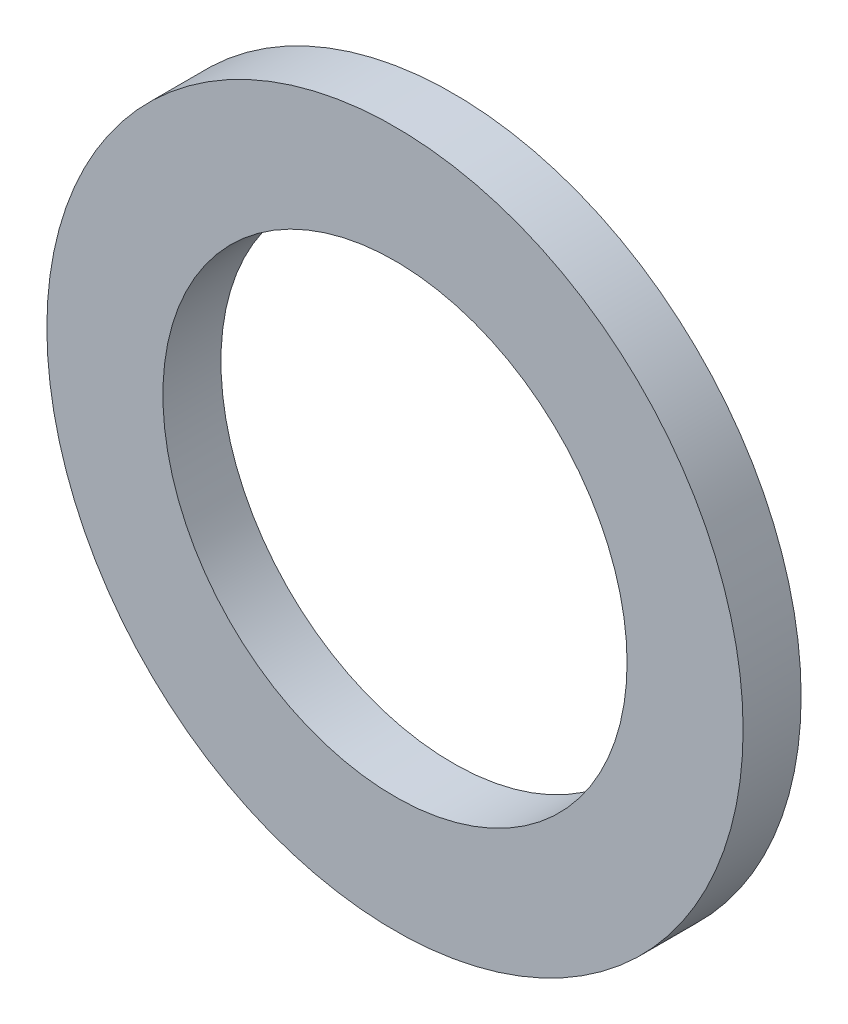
from build123d import *

# Parameters (mm, degrees)
ESQUISSE1_R          = 3
ESQUISSE1_R_2        = 2
BASE_EXTRUSION_DEPTH = 0.5


with BuildPart() as part:
    # Esquisse1 → Base-Extrusion (new body)
    with BuildSketch(Plane(origin=(0, 0, -0.5), x_dir=(-1, 0, 0), z_dir=(0, 0, -1))):
        with Locations(Location((0, 0, 0), (0, 0, 180))):
            Circle(ESQUISSE1_R)
        with Locations(Location((0, 0, 0), (0, 0, 180))):
            Circle(ESQUISSE1_R_2, mode=Mode.SUBTRACT)
    extrude(amount=-BASE_EXTRUSION_DEPTH)


solid = part.part
